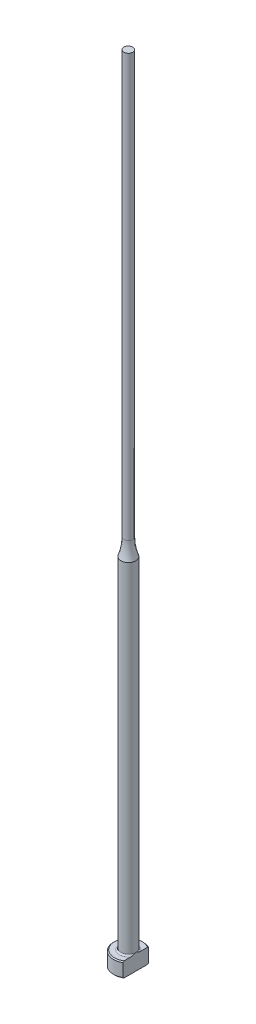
ISO-10303-21;
HEADER;
FILE_DESCRIPTION(('STEP AP214'),'2;1');
FILE_NAME('part.step','',(''),(''),'','','');
FILE_SCHEMA(('AUTOMOTIVE_DESIGN { 1 0 10303 214 1 1 1 1 }'));
ENDSEC;
DATA;
#1=APPLICATION_CONTEXT('core data for automotive mechanical design processes');
#2=APPLICATION_PROTOCOL_DEFINITION('international standard','automotive_design',2000,#1);
#3=PRODUCT_CONTEXT('',#1,'mechanical');
#4=PRODUCT('Part','Part','',(#3));
#5=PRODUCT_RELATED_PRODUCT_CATEGORY('part','',(#4));
#6=PRODUCT_DEFINITION_FORMATION('','',#4);
#7=PRODUCT_DEFINITION_CONTEXT('part definition',#1,'design');
#8=PRODUCT_DEFINITION('design','',#6,#7);
#9=PRODUCT_DEFINITION_SHAPE('','',#8);
#10=(LENGTH_UNIT() NAMED_UNIT(*) SI_UNIT(.MILLI.,.METRE.));
#11=(NAMED_UNIT(*) PLANE_ANGLE_UNIT() SI_UNIT($,.RADIAN.));
#12=(NAMED_UNIT(*) SI_UNIT($,.STERADIAN.) SOLID_ANGLE_UNIT());
#13=UNCERTAINTY_MEASURE_WITH_UNIT(LENGTH_MEASURE(1.E-05),#10,'distance_accuracy_value','');
#14=(GEOMETRIC_REPRESENTATION_CONTEXT(3) GLOBAL_UNCERTAINTY_ASSIGNED_CONTEXT((#13)) GLOBAL_UNIT_ASSIGNED_CONTEXT((#10,
#11,#12)) REPRESENTATION_CONTEXT('',''));
#15=CARTESIAN_POINT('',(0.,0.,0.));
#16=DIRECTION('',(0.,0.,1.));
#17=DIRECTION('',(1.,0.,0.));
#18=AXIS2_PLACEMENT_3D('',#15,#16,#17);
#19=CARTESIAN_POINT('',(-2.99999999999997,3.,0.));
#20=DIRECTION('',(0.,1.,0.));
#21=DIRECTION('',(0.,0.,1.));
#22=AXIS2_PLACEMENT_3D('',#19,#20,#21);
#23=PLANE('',#22);
#24=CARTESIAN_POINT('',(0.,3.,0.));
#25=DIRECTION('',(0.,1.,0.));
#26=DIRECTION('',(0.,0.,1.));
#27=AXIS2_PLACEMENT_3D('',#24,#25,#26);
#28=CIRCLE('',#27,2.79999999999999);
#29=CARTESIAN_POINT('',(1.49999999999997,3.,-2.36431808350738));
#30=VERTEX_POINT('',#29);
#31=CARTESIAN_POINT('',(1.49999999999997,3.,2.36431808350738));
#32=VERTEX_POINT('',#31);
#33=EDGE_CURVE('E187',#30,#32,#28,.T.);
#34=ORIENTED_EDGE('',*,*,#33,.T.);
#35=DIRECTION('',(0.,0.,-1.));
#36=VECTOR('',#35,1.);
#37=CARTESIAN_POINT('',(1.49999999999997,3.,0.));
#38=LINE('',#37,#36);
#39=CARTESIAN_POINT('',(1.49999999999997,3.00000000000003,0.99498743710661));
#40=VERTEX_POINT('',#39);
#41=EDGE_CURVE('E57',#32,#40,#38,.T.);
#42=ORIENTED_EDGE('',*,*,#41,.T.);
#43=CARTESIAN_POINT('',(0.,3.,0.));
#44=DIRECTION('',(0.,1.,0.));
#45=DIRECTION('',(0.,0.,1.));
#46=AXIS2_PLACEMENT_3D('',#43,#44,#45);
#47=CIRCLE('',#46,1.79999999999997);
#48=CARTESIAN_POINT('',(1.49999999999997,3.00000000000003,-0.994987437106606));
#49=VERTEX_POINT('',#48);
#50=EDGE_CURVE('E108',#40,#49,#47,.F.);
#51=ORIENTED_EDGE('',*,*,#50,.T.);
#52=EDGE_CURVE('E137',#49,#30,#38,.T.);
#53=ORIENTED_EDGE('',*,*,#52,.T.);
#54=EDGE_LOOP('',(#34,#42,#51,#53));
#55=FACE_BOUND('',#54,.T.);
#56=ADVANCED_FACE('F32',(#55),#23,.T.);
#57=CARTESIAN_POINT('',(0.,259.958771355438,0.));
#58=DIRECTION('',(0.,1.,0.));
#59=DIRECTION('',(0.,0.,1.));
#60=AXIS2_PLACEMENT_3D('',#57,#58,#59);
#61=CYLINDRICAL_SURFACE('',#60,2.99999999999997);
#62=CARTESIAN_POINT('',(0.,2.80000000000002,0.));
#63=DIRECTION('',(0.,1.,0.));
#64=DIRECTION('',(0.,0.,1.));
#65=AXIS2_PLACEMENT_3D('',#62,#63,#64);
#66=CIRCLE('',#65,2.99999999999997);
#67=CARTESIAN_POINT('',(1.49999999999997,2.80000000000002,2.5980762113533));
#68=VERTEX_POINT('',#67);
#69=CARTESIAN_POINT('',(1.49999999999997,2.80000000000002,-2.5980762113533));
#70=VERTEX_POINT('',#69);
#71=EDGE_CURVE('E105',#68,#70,#66,.F.);
#72=ORIENTED_EDGE('',*,*,#71,.T.);
#73=DIRECTION('',(0.,-1.,0.));
#74=VECTOR('',#73,1.);
#75=CARTESIAN_POINT('',(1.49999999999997,160.,-2.5980762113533));
#76=LINE('',#75,#74);
#77=CARTESIAN_POINT('',(1.49999999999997,0.200000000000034,-2.5980762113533));
#78=VERTEX_POINT('',#77);
#79=EDGE_CURVE('E193',#70,#78,#76,.T.);
#80=ORIENTED_EDGE('',*,*,#79,.T.);
#81=CARTESIAN_POINT('',(0.,0.200000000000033,0.));
#82=DIRECTION('',(0.,-1.,0.));
#83=DIRECTION('',(0.,0.,-1.));
#84=AXIS2_PLACEMENT_3D('',#81,#82,#83);
#85=CIRCLE('',#84,2.99999999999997);
#86=CARTESIAN_POINT('',(1.49999999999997,0.200000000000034,2.5980762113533));
#87=VERTEX_POINT('',#86);
#88=EDGE_CURVE('E100',#78,#87,#85,.F.);
#89=ORIENTED_EDGE('',*,*,#88,.T.);
#90=DIRECTION('',(0.,-1.,0.));
#91=VECTOR('',#90,1.);
#92=CARTESIAN_POINT('',(1.49999999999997,160.,2.5980762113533));
#93=LINE('',#92,#91);
#94=EDGE_CURVE('E93',#68,#87,#93,.T.);
#95=ORIENTED_EDGE('',*,*,#94,.F.);
#96=EDGE_LOOP('',(#72,#80,#89,#95));
#97=FACE_BOUND('',#96,.T.);
#98=ADVANCED_FACE('F158',(#97),#61,.T.);
#99=CARTESIAN_POINT('',(0.,0.,0.));
#100=DIRECTION('',(0.,-1.,0.));
#101=DIRECTION('',(0.,0.,-1.));
#102=AXIS2_PLACEMENT_3D('',#99,#100,#101);
#103=PLANE('',#102);
#104=CARTESIAN_POINT('',(0.,0.,0.));
#105=DIRECTION('',(0.,-1.,0.));
#106=DIRECTION('',(0.,0.,-1.));
#107=AXIS2_PLACEMENT_3D('',#104,#105,#106);
#108=CIRCLE('',#107,2.79999999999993);
#109=CARTESIAN_POINT('',(1.49999999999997,0.,2.36431808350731));
#110=VERTEX_POINT('',#109);
#111=CARTESIAN_POINT('',(1.49999999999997,0.,-2.36431808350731));
#112=VERTEX_POINT('',#111);
#113=EDGE_CURVE('E98',#110,#112,#108,.T.);
#114=ORIENTED_EDGE('',*,*,#113,.T.);
#115=DIRECTION('',(0.,0.,1.));
#116=VECTOR('',#115,1.);
#117=CARTESIAN_POINT('',(1.49999999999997,0.,-2.5980762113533));
#118=LINE('',#117,#116);
#119=EDGE_CURVE('E83',#112,#110,#118,.T.);
#120=ORIENTED_EDGE('',*,*,#119,.T.);
#121=EDGE_LOOP('',(#114,#120));
#122=FACE_BOUND('',#121,.T.);
#123=ADVANCED_FACE('F103',(#122),#103,.T.);
#124=CARTESIAN_POINT('',(0.,3.,0.));
#125=DIRECTION('',(0.,-1.,0.));
#126=DIRECTION('',(0.,0.,-1.));
#127=AXIS2_PLACEMENT_3D('',#124,#125,#126);
#128=CONICAL_SURFACE('',#127,2.79999999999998,0.785398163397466);
#129=ORIENTED_EDGE('',*,*,#71,.F.);
#130=CARTESIAN_POINT('',(1.49999999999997,-0.111741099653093,5.71827621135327));
#131=CARTESIAN_POINT('',(1.49999999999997,0.0136183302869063,5.58866816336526));
#132=CARTESIAN_POINT('',(1.49999999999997,0.138843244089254,5.45892957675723));
#133=CARTESIAN_POINT('',(1.49999999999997,0.388944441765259,5.19911365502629));
#134=CARTESIAN_POINT('',(1.49999999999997,0.513820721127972,5.06903631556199));
#135=CARTESIAN_POINT('',(1.49999999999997,0.763205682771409,4.80840180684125));
#136=CARTESIAN_POINT('',(1.49999999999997,0.887714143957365,4.67784442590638));
#137=CARTESIAN_POINT('',(1.49999999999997,1.13618059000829,4.41620813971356));
#138=CARTESIAN_POINT('',(1.49999999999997,1.26013857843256,4.28512923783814));
#139=CARTESIAN_POINT('',(1.49999999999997,1.50488975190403,4.02490837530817));
#140=CARTESIAN_POINT('',(1.49999999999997,1.6256969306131,3.89577958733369));
#141=CARTESIAN_POINT('',(1.49999999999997,1.86640694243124,3.63668213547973));
#142=CARTESIAN_POINT('',(1.49999999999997,1.98630978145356,3.50671347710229));
#143=CARTESIAN_POINT('',(1.49999999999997,2.22486033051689,3.24567921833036));
#144=CARTESIAN_POINT('',(1.49999999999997,2.34350830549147,3.11461386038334));
#145=CARTESIAN_POINT('',(1.49999999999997,2.57907716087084,2.85094268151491));
#146=CARTESIAN_POINT('',(1.49999999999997,2.69599811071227,2.71833692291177));
#147=CARTESIAN_POINT('',(1.49999999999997,2.88262371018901,2.50255231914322));
#148=CARTESIAN_POINT('',(1.49999999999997,2.95312454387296,2.42006293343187));
#149=CARTESIAN_POINT('',(1.49999999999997,3.0928709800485,2.25401084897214));
#150=CARTESIAN_POINT('',(1.49999999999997,3.16211645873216,2.17044804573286));
#151=CARTESIAN_POINT('',(1.49999999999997,3.29964684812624,2.00105967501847));
#152=CARTESIAN_POINT('',(1.49999999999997,3.36791386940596,1.91521952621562));
#153=CARTESIAN_POINT('',(1.49999999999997,3.50205840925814,1.74171392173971));
#154=CARTESIAN_POINT('',(1.49999999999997,3.56793649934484,1.65404891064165));
#155=CARTESIAN_POINT('',(1.49999999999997,3.69728151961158,1.47490236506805));
#156=CARTESIAN_POINT('',(1.49999999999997,3.76069661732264,1.38338308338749));
#157=CARTESIAN_POINT('',(1.49999999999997,3.8823953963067,1.19675661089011));
#158=CARTESIAN_POINT('',(1.49999999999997,3.94067201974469,1.10164473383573));
#159=CARTESIAN_POINT('',(1.49999999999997,4.04841325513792,0.908008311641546));
#160=CARTESIAN_POINT('',(1.49999999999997,4.0979780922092,0.809540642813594));
#161=CARTESIAN_POINT('',(1.49999999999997,4.18432188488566,0.607192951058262));
#162=CARTESIAN_POINT('',(1.49999999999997,4.22114374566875,0.503332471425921));
#163=CARTESIAN_POINT('',(1.49999999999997,4.26099935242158,0.347577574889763));
#164=CARTESIAN_POINT('',(1.49999999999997,4.27157029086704,0.297609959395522));
#165=CARTESIAN_POINT('',(1.49999999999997,4.28794860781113,0.196885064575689));
#166=CARTESIAN_POINT('',(1.49999999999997,4.29375640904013,0.146127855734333));
#167=CARTESIAN_POINT('',(1.49999999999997,4.30019707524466,0.0444388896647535));
#168=CARTESIAN_POINT('',(1.49999999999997,4.30084594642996,-0.00649183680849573));
#169=CARTESIAN_POINT('',(1.49999999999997,4.29696416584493,-0.108155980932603));
#170=CARTESIAN_POINT('',(1.49999999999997,4.29243308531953,-0.15888938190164));
#171=CARTESIAN_POINT('',(1.49999999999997,4.27856915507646,-0.259234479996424));
#172=CARTESIAN_POINT('',(1.49999999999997,4.26927821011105,-0.30885208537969));
#173=CARTESIAN_POINT('',(1.49999999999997,4.24647108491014,-0.407110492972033));
#174=CARTESIAN_POINT('',(1.49999999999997,4.2329532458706,-0.455750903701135));
#175=CARTESIAN_POINT('',(1.49999999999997,4.20226175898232,-0.552149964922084));
#176=CARTESIAN_POINT('',(1.49999999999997,4.18506801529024,-0.599902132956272));
#177=CARTESIAN_POINT('',(1.49999999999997,4.14771387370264,-0.694205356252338));
#178=CARTESIAN_POINT('',(1.49999999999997,4.1275540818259,-0.740756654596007));
#179=CARTESIAN_POINT('',(1.49999999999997,4.06327696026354,-0.879166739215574));
#180=CARTESIAN_POINT('',(1.49999999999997,4.01551721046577,-0.969329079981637));
#181=CARTESIAN_POINT('',(1.49999999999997,3.91367909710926,-1.1460431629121));
#182=CARTESIAN_POINT('',(1.49999999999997,3.85959300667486,-1.23259031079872));
#183=CARTESIAN_POINT('',(1.49999999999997,3.74697968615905,-1.40321348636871));
#184=CARTESIAN_POINT('',(1.49999999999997,3.68843573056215,-1.48727838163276));
#185=CARTESIAN_POINT('',(1.49999999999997,3.56843845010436,-1.65322187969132));
#186=CARTESIAN_POINT('',(1.49999999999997,3.50698656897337,-1.73510153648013));
#187=CARTESIAN_POINT('',(1.49999999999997,3.38115673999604,-1.89829823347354));
#188=CARTESIAN_POINT('',(1.49999999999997,3.31675092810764,-1.97959369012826));
#189=CARTESIAN_POINT('',(1.49999999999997,3.18634068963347,-2.14090082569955));
#190=CARTESIAN_POINT('',(1.49999999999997,3.12033609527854,-2.22091236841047));
#191=CARTESIAN_POINT('',(1.49999999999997,2.92086431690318,-2.45906508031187));
#192=CARTESIAN_POINT('',(1.49999999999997,2.78562663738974,-2.61572090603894));
#193=CARTESIAN_POINT('',(1.49999999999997,2.53554498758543,-2.90006295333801));
#194=CARTESIAN_POINT('',(1.49999999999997,2.42114543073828,-3.02814382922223));
#195=CARTESIAN_POINT('',(1.49999999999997,2.19093557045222,-3.28303767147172));
#196=CARTESIAN_POINT('',(1.49999999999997,2.07512522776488,-3.40985060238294));
#197=CARTESIAN_POINT('',(1.49999999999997,1.72597067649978,-3.7891384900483));
#198=CARTESIAN_POINT('',(1.49999999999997,1.49111760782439,-4.04022177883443));
#199=CARTESIAN_POINT('',(1.49999999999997,1.02882478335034,-4.52992803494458));
#200=CARTESIAN_POINT('',(1.49999999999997,0.801477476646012,-4.76863870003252));
#201=CARTESIAN_POINT('',(1.49999999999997,0.459548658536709,-5.12558036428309));
#202=CARTESIAN_POINT('',(1.49999999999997,0.345484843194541,-5.2443077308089));
#203=CARTESIAN_POINT('',(1.49999999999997,0.117071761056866,-5.48148573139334));
#204=CARTESIAN_POINT('',(1.49999999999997,0.00272249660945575,-5.59993636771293));
#205=CARTESIAN_POINT('',(1.49999999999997,-0.111741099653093,-5.71827621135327));
#206=B_SPLINE_CURVE_WITH_KNOTS('',3,(#130,#131,#132,#133,#134,#135,#136,#137,#138,#139,#140,
#141,#142,#143,#144,#145,#146,#147,#148,#149,#150,#151,#152,#153,#154,#155,#156,#157,#158,#159,
#160,#161,#162,#163,#164,#165,#166,#167,#168,#169,#170,#171,#172,#173,#174,#175,#176,#177,#178,
#179,#180,#181,#182,#183,#184,#185,#186,#187,#188,#189,#190,#191,#192,#193,#194,#195,#196,#197,
#198,#199,#200,#201,#202,#203,#204,#205),.UNSPECIFIED.,.F.,.F.,(4,2,2,2,2,2,2,2,2,2,2,2,2,2,2,2,
2,2,2,2,2,2,2,2,2,2,2,2,2,2,2,2,2,2,2,2,2,4),(0.,0.540943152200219,1.08189327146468,
1.62312052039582,2.16434426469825,2.69482920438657,3.22531067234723,3.75567781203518,
4.2860235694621,4.61155053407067,4.93710943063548,5.2661094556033,5.59503024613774,
5.92894782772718,6.26331713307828,6.59354403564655,6.92264800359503,7.0756747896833,
7.22868799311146,7.38122626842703,7.53377717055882,7.68500755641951,7.83629736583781,
7.98843643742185,8.14054446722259,8.44618799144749,8.75220879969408,9.05944044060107,
9.36652111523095,9.67764287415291,9.98879742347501,10.6095925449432,11.1247803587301,
11.6399825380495,12.6713544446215,13.6603005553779,14.1542238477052,14.6481430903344),.UNSPECIFIED.);
#207=EDGE_CURVE('E136',#68,#32,#206,.T.);
#208=ORIENTED_EDGE('',*,*,#207,.T.);
#209=ORIENTED_EDGE('',*,*,#33,.F.);
#210=EDGE_CURVE('E128',#30,#70,#206,.T.);
#211=ORIENTED_EDGE('',*,*,#210,.T.);
#212=EDGE_LOOP('',(#129,#208,#209,#211));
#213=FACE_BOUND('',#212,.T.);
#214=ADVANCED_FACE('F144',(#213),#128,.T.);
#215=CARTESIAN_POINT('',(0.,0.200000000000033,0.));
#216=DIRECTION('',(0.,1.,0.));
#217=DIRECTION('',(0.,0.,1.));
#218=AXIS2_PLACEMENT_3D('',#215,#216,#217);
#219=CONICAL_SURFACE('',#218,2.99999999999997,0.785398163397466);
#220=ORIENTED_EDGE('',*,*,#88,.F.);
#221=CARTESIAN_POINT('',(1.49999999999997,3.11174109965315,-5.71827621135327));
#222=CARTESIAN_POINT('',(1.49999999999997,2.98638166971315,-5.58866816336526));
#223=CARTESIAN_POINT('',(1.49999999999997,2.8611567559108,-5.45892957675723));
#224=CARTESIAN_POINT('',(1.49999999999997,2.6110555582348,-5.19911365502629));
#225=CARTESIAN_POINT('',(1.49999999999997,2.48617927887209,-5.06903631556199));
#226=CARTESIAN_POINT('',(1.49999999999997,2.23679431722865,-4.80840180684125));
#227=CARTESIAN_POINT('',(1.49999999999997,2.11228585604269,-4.67784442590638));
#228=CARTESIAN_POINT('',(1.49999999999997,1.86381940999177,-4.41620813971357));
#229=CARTESIAN_POINT('',(1.49999999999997,1.7398614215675,-4.28512923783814));
#230=CARTESIAN_POINT('',(1.49999999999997,1.49511024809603,-4.02490837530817));
#231=CARTESIAN_POINT('',(1.49999999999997,1.37430306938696,-3.89577958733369));
#232=CARTESIAN_POINT('',(1.49999999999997,1.13359305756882,-3.63668213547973));
#233=CARTESIAN_POINT('',(1.49999999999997,1.0136902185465,-3.50671347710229));
#234=CARTESIAN_POINT('',(1.49999999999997,0.775139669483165,-3.24567921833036));
#235=CARTESIAN_POINT('',(1.49999999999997,0.656491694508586,-3.11461386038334));
#236=CARTESIAN_POINT('',(1.49999999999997,0.420922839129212,-2.85094268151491));
#237=CARTESIAN_POINT('',(1.49999999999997,0.304001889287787,-2.71833692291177));
#238=CARTESIAN_POINT('',(1.49999999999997,0.117376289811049,-2.50255231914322));
#239=CARTESIAN_POINT('',(1.49999999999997,0.0468754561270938,-2.42006293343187));
#240=CARTESIAN_POINT('',(1.49999999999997,-0.0928709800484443,-2.25401084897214));
#241=CARTESIAN_POINT('',(1.49999999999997,-0.162116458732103,-2.17044804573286));
#242=CARTESIAN_POINT('',(1.49999999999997,-0.299646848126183,-2.00105967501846));
#243=CARTESIAN_POINT('',(1.49999999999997,-0.367913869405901,-1.91521952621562));
#244=CARTESIAN_POINT('',(1.49999999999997,-0.502058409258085,-1.74171392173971));
#245=CARTESIAN_POINT('',(1.49999999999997,-0.567936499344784,-1.65404891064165));
#246=CARTESIAN_POINT('',(1.49999999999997,-0.697281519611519,-1.47490236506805));
#247=CARTESIAN_POINT('',(1.49999999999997,-0.760696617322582,-1.38338308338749));
#248=CARTESIAN_POINT('',(1.49999999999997,-0.882395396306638,-1.19675661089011));
#249=CARTESIAN_POINT('',(1.49999999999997,-0.940672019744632,-1.10164473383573));
#250=CARTESIAN_POINT('',(1.49999999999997,-1.04841325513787,-0.908008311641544));
#251=CARTESIAN_POINT('',(1.49999999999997,-1.09797809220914,-0.809540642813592));
#252=CARTESIAN_POINT('',(1.49999999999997,-1.1843218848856,-0.60719295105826));
#253=CARTESIAN_POINT('',(1.49999999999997,-1.22114374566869,-0.503332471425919));
#254=CARTESIAN_POINT('',(1.49999999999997,-1.26099935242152,-0.347577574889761));
#255=CARTESIAN_POINT('',(1.49999999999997,-1.27157029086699,-0.29760995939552));
#256=CARTESIAN_POINT('',(1.49999999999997,-1.28794860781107,-0.196885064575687));
#257=CARTESIAN_POINT('',(1.49999999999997,-1.29375640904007,-0.146127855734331));
#258=CARTESIAN_POINT('',(1.49999999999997,-1.30019707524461,-0.0444388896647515));
#259=CARTESIAN_POINT('',(1.49999999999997,-1.3008459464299,0.00649183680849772));
#260=CARTESIAN_POINT('',(1.49999999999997,-1.29696416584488,0.108155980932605));
#261=CARTESIAN_POINT('',(1.49999999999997,-1.29243308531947,0.158889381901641));
#262=CARTESIAN_POINT('',(1.49999999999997,-1.2785691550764,0.259234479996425));
#263=CARTESIAN_POINT('',(1.49999999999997,-1.26927821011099,0.308852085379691));
#264=CARTESIAN_POINT('',(1.49999999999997,-1.24647108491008,0.407110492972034));
#265=CARTESIAN_POINT('',(1.49999999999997,-1.23295324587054,0.455750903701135));
#266=CARTESIAN_POINT('',(1.49999999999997,-1.20226175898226,0.552149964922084));
#267=CARTESIAN_POINT('',(1.49999999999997,-1.18506801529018,0.599902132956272));
#268=CARTESIAN_POINT('',(1.49999999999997,-1.14771387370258,0.694205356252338));
#269=CARTESIAN_POINT('',(1.49999999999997,-1.12755408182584,0.740756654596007));
#270=CARTESIAN_POINT('',(1.49999999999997,-1.06327696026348,0.879166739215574));
#271=CARTESIAN_POINT('',(1.49999999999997,-1.01551721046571,0.969329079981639));
#272=CARTESIAN_POINT('',(1.49999999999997,-0.913679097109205,1.1460431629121));
#273=CARTESIAN_POINT('',(1.49999999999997,-0.8595930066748,1.23259031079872));
#274=CARTESIAN_POINT('',(1.49999999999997,-0.746979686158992,1.40321348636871));
#275=CARTESIAN_POINT('',(1.49999999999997,-0.688435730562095,1.48727838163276));
#276=CARTESIAN_POINT('',(1.49999999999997,-0.568438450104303,1.65322187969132));
#277=CARTESIAN_POINT('',(1.49999999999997,-0.506986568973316,1.73510153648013));
#278=CARTESIAN_POINT('',(1.49999999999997,-0.381156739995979,1.89829823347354));
#279=CARTESIAN_POINT('',(1.49999999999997,-0.316750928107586,1.97959369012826));
#280=CARTESIAN_POINT('',(1.49999999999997,-0.186340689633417,2.14090082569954));
#281=CARTESIAN_POINT('',(1.49999999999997,-0.120336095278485,2.22091236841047));
#282=CARTESIAN_POINT('',(1.49999999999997,0.0791356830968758,2.45906508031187));
#283=CARTESIAN_POINT('',(1.49999999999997,0.214373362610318,2.61572090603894));
#284=CARTESIAN_POINT('',(1.49999999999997,0.46445501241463,2.90006295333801));
#285=CARTESIAN_POINT('',(1.49999999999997,0.578854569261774,3.02814382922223));
#286=CARTESIAN_POINT('',(1.49999999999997,0.809064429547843,3.28303767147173));
#287=CARTESIAN_POINT('',(1.49999999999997,0.924874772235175,3.40985060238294));
#288=CARTESIAN_POINT('',(1.49999999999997,1.27402932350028,3.78913849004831));
#289=CARTESIAN_POINT('',(1.49999999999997,1.50888239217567,4.04022177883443));
#290=CARTESIAN_POINT('',(1.49999999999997,1.97117521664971,4.52992803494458));
#291=CARTESIAN_POINT('',(1.49999999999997,2.19852252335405,4.76863870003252));
#292=CARTESIAN_POINT('',(1.49999999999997,2.54045134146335,5.12558036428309));
#293=CARTESIAN_POINT('',(1.49999999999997,2.65451515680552,5.2443077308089));
#294=CARTESIAN_POINT('',(1.49999999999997,2.88292823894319,5.48148573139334));
#295=CARTESIAN_POINT('',(1.49999999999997,2.9972775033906,5.59993636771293));
#296=CARTESIAN_POINT('',(1.49999999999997,3.11174109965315,5.71827621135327));
#297=B_SPLINE_CURVE_WITH_KNOTS('',3,(#221,#222,#223,#224,#225,#226,#227,#228,#229,#230,#231,
#232,#233,#234,#235,#236,#237,#238,#239,#240,#241,#242,#243,#244,#245,#246,#247,#248,#249,#250,
#251,#252,#253,#254,#255,#256,#257,#258,#259,#260,#261,#262,#263,#264,#265,#266,#267,#268,#269,
#270,#271,#272,#273,#274,#275,#276,#277,#278,#279,#280,#281,#282,#283,#284,#285,#286,#287,#288,
#289,#290,#291,#292,#293,#294,#295,#296),.UNSPECIFIED.,.F.,.F.,(4,2,2,2,2,2,2,2,2,2,2,2,2,2,2,2,
2,2,2,2,2,2,2,2,2,2,2,2,2,2,2,2,2,2,2,2,2,4),(0.,0.540943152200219,1.08189327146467,
1.62312052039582,2.16434426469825,2.69482920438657,3.22531067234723,3.75567781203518,
4.28602356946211,4.61155053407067,4.93710943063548,5.2661094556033,5.59503024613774,
5.92894782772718,6.26331713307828,6.59354403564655,6.92264800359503,7.0756747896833,
7.22868799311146,7.38122626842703,7.53377717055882,7.68500755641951,7.83629736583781,
7.98843643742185,8.14054446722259,8.4461879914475,8.75220879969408,9.05944044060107,
9.36652111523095,9.6776428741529,9.98879742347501,10.6095925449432,11.1247803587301,
11.6399825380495,12.6713544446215,13.6603005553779,14.1542238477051,14.6481430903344),.UNSPECIFIED.);
#298=EDGE_CURVE('E86',#78,#112,#297,.T.);
#299=ORIENTED_EDGE('',*,*,#298,.T.);
#300=ORIENTED_EDGE('',*,*,#113,.F.);
#301=EDGE_CURVE('E89',#110,#87,#297,.T.);
#302=ORIENTED_EDGE('',*,*,#301,.T.);
#303=EDGE_LOOP('',(#220,#299,#300,#302));
#304=FACE_BOUND('',#303,.T.);
#305=ADVANCED_FACE('F97',(#304),#219,.T.);
#306=CARTESIAN_POINT('',(0.,3.30000000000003,0.));
#307=DIRECTION('',(0.,1.,0.));
#308=DIRECTION('',(0.,0.,1.));
#309=AXIS2_PLACEMENT_3D('',#306,#307,#308);
#310=TOROIDAL_SURFACE('',#309,1.79999999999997,0.3);
#311=CARTESIAN_POINT('',(1.49999999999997,3.30000000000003,0.));
#312=CARTESIAN_POINT('',(1.49999999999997,3.300000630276,3.41555678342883E-12));
#313=CARTESIAN_POINT('',(1.49999999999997,3.30000126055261,-1.15373640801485E-07));
#314=CARTESIAN_POINT('',(1.49999999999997,3.3000024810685,-4.90631575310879E-07));
#315=CARTESIAN_POINT('',(1.49999999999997,3.30000307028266,-7.53296670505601E-07));
#316=CARTESIAN_POINT('',(1.49999999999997,3.30000424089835,-1.38757096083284E-06));
#317=CARTESIAN_POINT('',(1.49999999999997,3.300004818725,-1.76563001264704E-06));
#318=CARTESIAN_POINT('',(1.49999999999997,3.30000591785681,-2.58768006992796E-06));
#319=CARTESIAN_POINT('',(1.49999999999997,3.30000643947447,-3.03127014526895E-06));
#320=CARTESIAN_POINT('',(1.49999999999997,3.30000815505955,-4.60021967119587E-06));
#321=CARTESIAN_POINT('',(1.49999999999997,3.30000927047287,-5.8124152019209E-06));
#322=CARTESIAN_POINT('',(1.49999999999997,3.30001128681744,-8.33989413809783E-06));
#323=CARTESIAN_POINT('',(1.49999999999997,3.30001219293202,-9.65128157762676E-06));
#324=CARTESIAN_POINT('',(1.49999999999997,3.30001551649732,-1.46782505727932E-05));
#325=CARTESIAN_POINT('',(1.49999999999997,3.30001775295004,-1.8517976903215E-05));
#326=CARTESIAN_POINT('',(1.49999999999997,3.30002148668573,-2.61616194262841E-05));
#327=CARTESIAN_POINT('',(1.49999999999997,3.30002302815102,-2.99447742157E-05));
#328=CARTESIAN_POINT('',(1.49999999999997,3.30002943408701,-4.58003743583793E-05));
#329=CARTESIAN_POINT('',(1.49999999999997,3.3000341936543,-5.79079078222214E-05));
#330=CARTESIAN_POINT('',(1.49999999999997,3.30004197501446,-8.07263755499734E-05));
#331=CARTESIAN_POINT('',(1.49999999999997,3.30004514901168,-9.13834709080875E-05));
#332=CARTESIAN_POINT('',(1.49999999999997,3.30006989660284,-0.000167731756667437));
#333=CARTESIAN_POINT('',(1.49999999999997,3.30010092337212,-0.000229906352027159));
#334=CARTESIAN_POINT('',(1.49999999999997,3.30021632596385,-0.000470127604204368));
#335=CARTESIAN_POINT('',(1.49999999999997,3.30029368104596,-0.000650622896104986));
#336=CARTESIAN_POINT('',(1.49999999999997,3.30059619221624,-0.00134589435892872));
#337=CARTESIAN_POINT('',(1.49999999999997,3.30082870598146,-0.00185814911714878));
#338=CARTESIAN_POINT('',(1.49999999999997,3.30176696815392,-0.00393547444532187));
#339=CARTESIAN_POINT('',(1.49999999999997,3.30246445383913,-0.00550332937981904));
#340=CARTESIAN_POINT('',(1.49999999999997,3.31426785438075,-0.0320229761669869));
#341=CARTESIAN_POINT('',(1.49999999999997,3.32544800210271,-0.0569503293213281));
#342=CARTESIAN_POINT('',(1.49999999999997,3.34725700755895,-0.105984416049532));
#343=CARTESIAN_POINT('',(1.49999999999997,3.35789134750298,-0.130088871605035));
#344=CARTESIAN_POINT('',(1.49999999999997,3.38015321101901,-0.181096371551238));
#345=CARTESIAN_POINT('',(1.49999999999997,3.39175804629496,-0.208009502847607));
#346=CARTESIAN_POINT('',(1.49999999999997,3.41469034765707,-0.262264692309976));
#347=CARTESIAN_POINT('',(1.49999999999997,3.42601398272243,-0.289608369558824));
#348=CARTESIAN_POINT('',(1.49999999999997,3.45363212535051,-0.35820378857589));
#349=CARTESIAN_POINT('',(1.49999999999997,3.46959026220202,-0.39959288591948));
#350=CARTESIAN_POINT('',(1.49999999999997,3.49940505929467,-0.482097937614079));
#351=CARTESIAN_POINT('',(1.49999999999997,3.51330033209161,-0.523199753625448));
#352=CARTESIAN_POINT('',(1.49999999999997,3.53552507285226,-0.595497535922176));
#353=CARTESIAN_POINT('',(1.49999999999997,3.54436834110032,-0.626532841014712));
#354=CARTESIAN_POINT('',(1.49999999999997,3.56052427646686,-0.6891760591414));
#355=CARTESIAN_POINT('',(1.49999999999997,3.5678279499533,-0.720786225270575));
#356=CARTESIAN_POINT('',(1.49999999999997,3.5875075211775,-0.819524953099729));
#357=CARTESIAN_POINT('',(1.49999999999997,3.59661044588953,-0.88742909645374));
#358=CARTESIAN_POINT('',(1.49999999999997,3.60059842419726,-0.991180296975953));
#359=CARTESIAN_POINT('',(1.49999999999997,3.60019840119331,-1.02684364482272));
#360=CARTESIAN_POINT('',(1.49999999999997,3.59497085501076,-1.097505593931));
#361=CARTESIAN_POINT('',(1.49999999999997,3.59019295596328,-1.13250716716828));
#362=CARTESIAN_POINT('',(1.49999999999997,3.57687734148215,-1.19353096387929));
#363=CARTESIAN_POINT('',(1.49999999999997,3.56943875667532,-1.21978854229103));
#364=CARTESIAN_POINT('',(1.49999999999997,3.55063748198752,-1.27094658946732));
#365=CARTESIAN_POINT('',(1.49999999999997,3.53927342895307,-1.29584658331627));
#366=CARTESIAN_POINT('',(1.49999999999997,3.51660016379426,-1.33501873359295));
#367=CARTESIAN_POINT('',(1.49999999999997,3.50657738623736,-1.35003296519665));
#368=CARTESIAN_POINT('',(1.49999999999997,3.48437469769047,-1.37837252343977));
#369=CARTESIAN_POINT('',(1.49999999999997,3.47219867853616,-1.39170082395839));
#370=CARTESIAN_POINT('',(1.49999999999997,3.44835614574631,-1.41349417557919));
#371=CARTESIAN_POINT('',(1.49999999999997,3.43709185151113,-1.42239673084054));
#372=CARTESIAN_POINT('',(1.49999999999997,3.41325256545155,-1.43825467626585));
#373=CARTESIAN_POINT('',(1.49999999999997,3.40067804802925,-1.44521076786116));
#374=CARTESIAN_POINT('',(1.49999999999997,3.37433767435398,-1.45677158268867));
#375=CARTESIAN_POINT('',(1.49999999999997,3.36056203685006,-1.46135438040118));
#376=CARTESIAN_POINT('',(1.49999999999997,3.33237324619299,-1.46767730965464));
#377=CARTESIAN_POINT('',(1.49999999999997,3.31796076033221,-1.46942034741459));
#378=CARTESIAN_POINT('',(1.49999999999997,3.29122479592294,-1.4698720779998));
#379=CARTESIAN_POINT('',(1.49999999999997,3.27890664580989,-1.468990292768));
#380=CARTESIAN_POINT('',(1.49999999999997,3.25461019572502,-1.4651157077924));
#381=CARTESIAN_POINT('',(1.49999999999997,3.2426318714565,-1.46212305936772));
#382=CARTESIAN_POINT('',(1.49999999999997,3.21959683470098,-1.4543117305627));
#383=CARTESIAN_POINT('',(1.49999999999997,3.20852542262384,-1.44953579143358));
#384=CARTESIAN_POINT('',(1.49999999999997,3.18721125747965,-1.43840957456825));
#385=CARTESIAN_POINT('',(1.49999999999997,3.1769687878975,-1.43205876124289));
#386=CARTESIAN_POINT('',(1.49999999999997,3.15325976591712,-1.41506353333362));
#387=CARTESIAN_POINT('',(1.49999999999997,3.14027750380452,-1.40374235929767));
#388=CARTESIAN_POINT('',(1.49999999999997,3.11630720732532,-1.37914825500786));
#389=CARTESIAN_POINT('',(1.49999999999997,3.10532420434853,-1.36587054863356));
#390=CARTESIAN_POINT('',(1.49999999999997,3.08100891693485,-1.33197272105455));
#391=CARTESIAN_POINT('',(1.49999999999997,3.06867625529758,-1.31063843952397));
#392=CARTESIAN_POINT('',(1.49999999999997,3.04751867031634,-1.26637455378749));
#393=CARTESIAN_POINT('',(1.49999999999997,3.03869240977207,-1.24344556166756));
#394=CARTESIAN_POINT('',(1.49999999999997,3.01978360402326,-1.18316534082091));
#395=CARTESIAN_POINT('',(1.49999999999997,3.01191472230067,-1.14512623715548));
#396=CARTESIAN_POINT('',(1.49999999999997,3.00188285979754,-1.06789971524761));
#397=CARTESIAN_POINT('',(1.49999999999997,2.99979735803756,-1.02870374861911));
#398=CARTESIAN_POINT('',(1.49999999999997,3.00021727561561,-0.953160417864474));
#399=CARTESIAN_POINT('',(1.49999999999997,3.00240673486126,-0.916808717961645));
#400=CARTESIAN_POINT('',(1.49999999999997,3.0099643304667,-0.844432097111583));
#401=CARTESIAN_POINT('',(1.49999999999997,3.01533462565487,-0.808407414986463));
#402=CARTESIAN_POINT('',(1.49999999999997,3.02828086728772,-0.738670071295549));
#403=CARTESIAN_POINT('',(1.49999999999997,3.03573028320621,-0.704933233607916));
#404=CARTESIAN_POINT('',(1.49999999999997,3.05243174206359,-0.638128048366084));
#405=CARTESIAN_POINT('',(1.49999999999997,3.06167285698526,-0.605056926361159));
#406=CARTESIAN_POINT('',(1.49999999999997,3.08440652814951,-0.53019513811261));
#407=CARTESIAN_POINT('',(1.49999999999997,3.09836576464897,-0.488547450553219));
#408=CARTESIAN_POINT('',(1.49999999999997,3.1283820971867,-0.404954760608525));
#409=CARTESIAN_POINT('',(1.49999999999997,3.14447968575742,-0.363024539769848));
#410=CARTESIAN_POINT('',(1.49999999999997,3.17238454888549,-0.293508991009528));
#411=CARTESIAN_POINT('',(1.49999999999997,3.18384249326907,-0.265781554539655));
#412=CARTESIAN_POINT('',(1.49999999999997,3.20705854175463,-0.210769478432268));
#413=CARTESIAN_POINT('',(1.49999999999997,3.21881265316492,-0.183483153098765));
#414=CARTESIAN_POINT('',(1.49999999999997,3.24136702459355,-0.131772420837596));
#415=CARTESIAN_POINT('',(1.49999999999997,3.25214361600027,-0.107337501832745));
#416=CARTESIAN_POINT('',(1.49999999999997,3.27424746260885,-0.0576321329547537));
#417=CARTESIAN_POINT('',(1.49999999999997,3.28558038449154,-0.0323640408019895));
#418=CARTESIAN_POINT('',(1.49999999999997,3.29753556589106,-0.00550327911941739));
#419=CARTESIAN_POINT('',(1.49999999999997,3.29823307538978,-0.00393537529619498));
#420=CARTESIAN_POINT('',(1.49999999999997,3.29917134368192,-0.00185803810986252));
#421=CARTESIAN_POINT('',(1.49999999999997,3.29940384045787,-0.00134582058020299));
#422=CARTESIAN_POINT('',(1.49999999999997,3.29970633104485,-0.000650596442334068));
#423=CARTESIAN_POINT('',(1.49999999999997,3.29978368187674,-0.000470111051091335));
#424=CARTESIAN_POINT('',(1.49999999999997,3.29989907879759,-0.000229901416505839));
#425=CARTESIAN_POINT('',(1.49999999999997,3.29993010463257,-0.000167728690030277));
#426=CARTESIAN_POINT('',(1.49999999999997,3.29995485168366,-9.13825689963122E-05));
#427=CARTESIAN_POINT('',(1.49999999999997,3.29995802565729,-8.07256241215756E-05));
#428=CARTESIAN_POINT('',(1.49999999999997,3.29996580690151,-5.79074820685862E-05));
#429=CARTESIAN_POINT('',(1.49999999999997,3.29997056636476,-4.5800119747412E-05));
#430=CARTESIAN_POINT('',(1.49999999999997,3.29997697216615,-2.99447119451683E-05));
#431=CARTESIAN_POINT('',(1.49999999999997,3.2999785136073,-2.61615817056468E-05));
#432=CARTESIAN_POINT('',(1.49999999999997,3.2999822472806,-1.85179845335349E-05));
#433=CARTESIAN_POINT('',(1.49999999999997,3.29998448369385,-1.46782782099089E-05));
#434=CARTESIAN_POINT('',(1.49999999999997,3.2999878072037,-9.65132752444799E-06));
#435=CARTESIAN_POINT('',(1.49999999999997,3.299988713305,-8.33994202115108E-06));
#436=CARTESIAN_POINT('',(1.49999999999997,3.29999072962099,-5.81246426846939E-06));
#437=CARTESIAN_POINT('',(1.49999999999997,3.29999184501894,-4.600267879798E-06));
#438=CARTESIAN_POINT('',(1.49999999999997,3.29999356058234,-3.03131394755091E-06));
#439=CARTESIAN_POINT('',(1.49999999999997,3.29999408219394,-2.58772196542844E-06));
#440=CARTESIAN_POINT('',(1.49999999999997,3.2999951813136,-1.76566701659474E-06));
#441=CARTESIAN_POINT('',(1.49999999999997,3.29999575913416,-1.38760497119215E-06));
#442=CARTESIAN_POINT('',(1.49999999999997,3.29999692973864,-7.53323425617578E-07));
#443=CARTESIAN_POINT('',(1.49999999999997,3.29999751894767,-4.90654189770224E-07));
#444=CARTESIAN_POINT('',(1.49999999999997,3.29999873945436,-1.15386267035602E-07));
#445=CARTESIAN_POINT('',(1.49999999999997,3.29999936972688,-3.41554144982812E-12));
#446=CARTESIAN_POINT('',(1.49999999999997,3.30000000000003,0.));
#447=B_SPLINE_CURVE_WITH_KNOTS('',3,(#311,#312,#313,#314,#315,#316,#317,#318,#319,#320,#321,
#322,#323,#324,#325,#326,#327,#328,#329,#330,#331,#332,#333,#334,#335,#336,#337,#338,#339,#340,
#341,#342,#343,#344,#345,#346,#347,#348,#349,#350,#351,#352,#353,#354,#355,#356,#357,#358,#359,
#360,#361,#362,#363,#364,#365,#366,#367,#368,#369,#370,#371,#372,#373,#374,#375,#376,#377,#378,
#379,#380,#381,#382,#383,#384,#385,#386,#387,#388,#389,#390,#391,#392,#393,#394,#395,#396,#397,
#398,#399,#400,#401,#402,#403,#404,#405,#406,#407,#408,#409,#410,#411,#412,#413,#414,#415,#416,
#417,#418,#419,#420,#421,#422,#423,#424,#425,#426,#427,#428,#429,#430,#431,#432,#433,#434,#435,
#436,#437,#438,#439,#440,#441,#442,#443,#444,#445,#446),.UNSPECIFIED.,.T.,.F.,(4,2,2,2,2,2,2,2,
2,2,2,2,2,2,2,2,2,2,2,2,2,2,2,2,2,2,2,2,2,2,2,2,2,2,2,2,2,2,2,2,2,2,2,2,2,2,2,2,2,2,2,2,2,2,2,2,
2,2,2,2,2,2,2,2,2,2,2,4),(0.,1.88906036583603E-06,3.8150959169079E-06,5.87892837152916E-06,
7.93062024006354E-06,1.28480890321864E-05,1.76261717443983E-05,3.0909918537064E-05,
4.31529750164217E-05,8.21699329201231E-05,0.000115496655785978,0.000323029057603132,
0.000912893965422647,0.00259963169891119,0.00774858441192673,0.0896975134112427,
0.168737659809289,0.256660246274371,0.345444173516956,0.478492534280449,0.608603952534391,
0.705372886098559,0.802692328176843,1.00719557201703,1.11399616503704,1.21960092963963,
1.30124317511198,1.38291380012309,1.43690814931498,1.49080588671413,1.53371524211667,
1.57660911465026,1.61989249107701,1.66313154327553,1.69999492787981,1.73685567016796,
1.77288440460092,1.80892540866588,1.86031324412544,1.91182866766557,1.98534297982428,
2.05882922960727,2.1747172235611,2.29215041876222,2.40123170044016,2.51038710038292,
2.613972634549,2.71694519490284,2.84866234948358,2.98337525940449,3.07337666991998,
3.16250453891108,3.24262397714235,3.32569301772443,3.3308421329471,3.33252874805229,
3.33311858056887,3.33332610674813,3.33335943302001,3.33339844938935,3.3334106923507,
3.33342397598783,3.33342875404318,3.33343367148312,3.33343572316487,3.33343778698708,
3.33343971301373,3.33344160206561),.UNSPECIFIED.);
#448=CARTESIAN_POINT('',(1.49999999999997,3.30000000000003,0.));
#449=VERTEX_POINT('',#448);
#450=EDGE_CURVE('E11',#49,#449,#447,.T.);
#451=ORIENTED_EDGE('',*,*,#450,.F.);
#452=ORIENTED_EDGE('',*,*,#50,.F.);
#453=CARTESIAN_POINT('',(1.49999999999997,3.30000000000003,0.));
#454=CARTESIAN_POINT('',(1.49999999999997,3.29999936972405,-3.41547770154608E-12));
#455=CARTESIAN_POINT('',(1.49999999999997,3.29999873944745,1.15373640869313E-07));
#456=CARTESIAN_POINT('',(1.49999999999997,3.29999751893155,4.90631575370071E-07));
#457=CARTESIAN_POINT('',(1.49999999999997,3.29999692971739,7.53296670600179E-07));
#458=CARTESIAN_POINT('',(1.49999999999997,3.2999957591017,1.38757096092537E-06));
#459=CARTESIAN_POINT('',(1.49999999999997,3.29999518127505,1.76563001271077E-06));
#460=CARTESIAN_POINT('',(1.49999999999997,3.29999408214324,2.58768007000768E-06));
#461=CARTESIAN_POINT('',(1.49999999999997,3.29999356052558,3.03127014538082E-06));
#462=CARTESIAN_POINT('',(1.49999999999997,3.2999918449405,4.60021967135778E-06));
#463=CARTESIAN_POINT('',(1.49999999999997,3.29999072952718,5.81241520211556E-06));
#464=CARTESIAN_POINT('',(1.49999999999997,3.29998871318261,8.33989413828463E-06));
#465=CARTESIAN_POINT('',(1.49999999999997,3.29998780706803,9.65128157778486E-06));
#466=CARTESIAN_POINT('',(1.49999999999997,3.29998448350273,1.46782505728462E-05));
#467=CARTESIAN_POINT('',(1.49999999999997,3.29998224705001,1.85179769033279E-05));
#468=CARTESIAN_POINT('',(1.49999999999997,3.29997851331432,2.61616194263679E-05));
#469=CARTESIAN_POINT('',(1.49999999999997,3.29997697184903,2.99447742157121E-05));
#470=CARTESIAN_POINT('',(1.49999999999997,3.29997056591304,4.58003743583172E-05));
#471=CARTESIAN_POINT('',(1.49999999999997,3.29996580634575,5.79079078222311E-05));
#472=CARTESIAN_POINT('',(1.49999999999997,3.29995802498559,8.07263755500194E-05));
#473=CARTESIAN_POINT('',(1.49999999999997,3.29995485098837,9.1383470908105E-05));
#474=CARTESIAN_POINT('',(1.49999999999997,3.29993010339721,0.000167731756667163));
#475=CARTESIAN_POINT('',(1.49999999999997,3.29989907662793,0.000229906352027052));
#476=CARTESIAN_POINT('',(1.49999999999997,3.2997836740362,0.000470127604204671));
#477=CARTESIAN_POINT('',(1.49999999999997,3.2997063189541,0.000650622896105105));
#478=CARTESIAN_POINT('',(1.49999999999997,3.29940380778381,0.00134589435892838));
#479=CARTESIAN_POINT('',(1.49999999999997,3.29917129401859,0.00185814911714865));
#480=CARTESIAN_POINT('',(1.49999999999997,3.29823303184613,0.00393547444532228));
#481=CARTESIAN_POINT('',(1.49999999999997,3.29753554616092,0.00550332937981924));
#482=CARTESIAN_POINT('',(1.49999999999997,3.2857321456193,0.0320229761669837));
#483=CARTESIAN_POINT('',(1.49999999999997,3.27455199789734,0.0569503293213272));
#484=CARTESIAN_POINT('',(1.49999999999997,3.2527429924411,0.105984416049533));
#485=CARTESIAN_POINT('',(1.49999999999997,3.24210865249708,0.130088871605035));
#486=CARTESIAN_POINT('',(1.49999999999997,3.21984678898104,0.181096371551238));
#487=CARTESIAN_POINT('',(1.49999999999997,3.20824195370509,0.208009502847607));
#488=CARTESIAN_POINT('',(1.49999999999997,3.18530965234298,0.262264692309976));
#489=CARTESIAN_POINT('',(1.49999999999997,3.17398601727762,0.289608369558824));
#490=CARTESIAN_POINT('',(1.49999999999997,3.14636787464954,0.35820378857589));
#491=CARTESIAN_POINT('',(1.49999999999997,3.13040973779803,0.39959288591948));
#492=CARTESIAN_POINT('',(1.49999999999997,3.10059494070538,0.482097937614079));
#493=CARTESIAN_POINT('',(1.49999999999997,3.08669966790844,0.523199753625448));
#494=CARTESIAN_POINT('',(1.49999999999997,3.06447492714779,0.595497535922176));
#495=CARTESIAN_POINT('',(1.49999999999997,3.05563165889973,0.626532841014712));
#496=CARTESIAN_POINT('',(1.49999999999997,3.03947572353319,0.6891760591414));
#497=CARTESIAN_POINT('',(1.49999999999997,3.03217205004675,0.720786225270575));
#498=CARTESIAN_POINT('',(1.49999999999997,3.01249247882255,0.819524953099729));
#499=CARTESIAN_POINT('',(1.49999999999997,3.00338955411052,0.88742909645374));
#500=CARTESIAN_POINT('',(1.49999999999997,2.99940157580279,0.991180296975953));
#501=CARTESIAN_POINT('',(1.49999999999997,2.99980159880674,1.02684364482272));
#502=CARTESIAN_POINT('',(1.49999999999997,3.00502914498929,1.097505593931));
#503=CARTESIAN_POINT('',(1.49999999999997,3.00980704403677,1.13250716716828));
#504=CARTESIAN_POINT('',(1.49999999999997,3.0231226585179,1.19353096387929));
#505=CARTESIAN_POINT('',(1.49999999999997,3.03056124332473,1.21978854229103));
#506=CARTESIAN_POINT('',(1.49999999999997,3.04936251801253,1.27094658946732));
#507=CARTESIAN_POINT('',(1.49999999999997,3.06072657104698,1.29584658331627));
#508=CARTESIAN_POINT('',(1.49999999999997,3.08339983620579,1.33501873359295));
#509=CARTESIAN_POINT('',(1.49999999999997,3.09342261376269,1.35003296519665));
#510=CARTESIAN_POINT('',(1.49999999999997,3.11562530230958,1.37837252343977));
#511=CARTESIAN_POINT('',(1.49999999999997,3.12780132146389,1.39170082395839));
#512=CARTESIAN_POINT('',(1.49999999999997,3.15164385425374,1.41349417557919));
#513=CARTESIAN_POINT('',(1.49999999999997,3.16290814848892,1.42239673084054));
#514=CARTESIAN_POINT('',(1.49999999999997,3.1867474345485,1.43825467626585));
#515=CARTESIAN_POINT('',(1.49999999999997,3.1993219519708,1.44521076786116));
#516=CARTESIAN_POINT('',(1.49999999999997,3.22566232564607,1.45677158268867));
#517=CARTESIAN_POINT('',(1.49999999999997,3.23943796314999,1.46135438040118));
#518=CARTESIAN_POINT('',(1.49999999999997,3.26762675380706,1.46767730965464));
#519=CARTESIAN_POINT('',(1.49999999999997,3.28203923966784,1.46942034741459));
#520=CARTESIAN_POINT('',(1.49999999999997,3.30877520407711,1.4698720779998));
#521=CARTESIAN_POINT('',(1.49999999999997,3.32109335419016,1.468990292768));
#522=CARTESIAN_POINT('',(1.49999999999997,3.34538980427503,1.4651157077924));
#523=CARTESIAN_POINT('',(1.49999999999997,3.35736812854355,1.46212305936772));
#524=CARTESIAN_POINT('',(1.49999999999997,3.38040316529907,1.4543117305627));
#525=CARTESIAN_POINT('',(1.49999999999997,3.39147457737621,1.44953579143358));
#526=CARTESIAN_POINT('',(1.49999999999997,3.4127887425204,1.43840957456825));
#527=CARTESIAN_POINT('',(1.49999999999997,3.42303121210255,1.43205876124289));
#528=CARTESIAN_POINT('',(1.49999999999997,3.44674023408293,1.41506353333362));
#529=CARTESIAN_POINT('',(1.49999999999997,3.45972249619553,1.40374235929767));
#530=CARTESIAN_POINT('',(1.49999999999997,3.48369279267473,1.37914825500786));
#531=CARTESIAN_POINT('',(1.49999999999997,3.49467579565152,1.36587054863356));
#532=CARTESIAN_POINT('',(1.49999999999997,3.5189910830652,1.33197272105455));
#533=CARTESIAN_POINT('',(1.49999999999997,3.53132374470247,1.31063843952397));
#534=CARTESIAN_POINT('',(1.49999999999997,3.55248132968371,1.26637455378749));
#535=CARTESIAN_POINT('',(1.49999999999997,3.56130759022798,1.24344556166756));
#536=CARTESIAN_POINT('',(1.49999999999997,3.58021639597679,1.18316534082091));
#537=CARTESIAN_POINT('',(1.49999999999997,3.58808527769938,1.14512623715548));
#538=CARTESIAN_POINT('',(1.49999999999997,3.59811714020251,1.06789971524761));
#539=CARTESIAN_POINT('',(1.49999999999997,3.60020264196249,1.02870374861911));
#540=CARTESIAN_POINT('',(1.49999999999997,3.59978272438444,0.953160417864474));
#541=CARTESIAN_POINT('',(1.49999999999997,3.59759326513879,0.916808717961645));
#542=CARTESIAN_POINT('',(1.49999999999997,3.59003566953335,0.844432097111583));
#543=CARTESIAN_POINT('',(1.49999999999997,3.58466537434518,0.808407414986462));
#544=CARTESIAN_POINT('',(1.49999999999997,3.57171913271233,0.738670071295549));
#545=CARTESIAN_POINT('',(1.49999999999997,3.56426971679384,0.704933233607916));
#546=CARTESIAN_POINT('',(1.49999999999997,3.54756825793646,0.638128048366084));
#547=CARTESIAN_POINT('',(1.49999999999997,3.53832714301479,0.605056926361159));
#548=CARTESIAN_POINT('',(1.49999999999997,3.51559347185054,0.53019513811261));
#549=CARTESIAN_POINT('',(1.49999999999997,3.50163423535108,0.488547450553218));
#550=CARTESIAN_POINT('',(1.49999999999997,3.47161790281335,0.404954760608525));
#551=CARTESIAN_POINT('',(1.49999999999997,3.45552031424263,0.363024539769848));
#552=CARTESIAN_POINT('',(1.49999999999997,3.42761545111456,0.293508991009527));
#553=CARTESIAN_POINT('',(1.49999999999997,3.41615750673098,0.265781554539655));
#554=CARTESIAN_POINT('',(1.49999999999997,3.39294145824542,0.210769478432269));
#555=CARTESIAN_POINT('',(1.49999999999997,3.38118734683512,0.183483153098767));
#556=CARTESIAN_POINT('',(1.49999999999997,3.3586329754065,0.131772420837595));
#557=CARTESIAN_POINT('',(1.49999999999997,3.3478563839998,0.10733750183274));
#558=CARTESIAN_POINT('',(1.49999999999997,3.32575253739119,0.0576321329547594));
#559=CARTESIAN_POINT('',(1.49999999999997,3.31441961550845,0.0323640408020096));
#560=CARTESIAN_POINT('',(1.49999999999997,3.30246443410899,0.00550327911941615));
#561=CARTESIAN_POINT('',(1.49999999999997,3.30176692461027,0.00393537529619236));
#562=CARTESIAN_POINT('',(1.49999999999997,3.30082865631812,0.00185803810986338));
#563=CARTESIAN_POINT('',(1.49999999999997,3.30059615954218,0.00134582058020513));
#564=CARTESIAN_POINT('',(1.49999999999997,3.3002936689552,0.000650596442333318));
#565=CARTESIAN_POINT('',(1.49999999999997,3.30021631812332,0.000470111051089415));
#566=CARTESIAN_POINT('',(1.49999999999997,3.30010092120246,0.000229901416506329));
#567=CARTESIAN_POINT('',(1.49999999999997,3.30006989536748,0.000167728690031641));
#568=CARTESIAN_POINT('',(1.49999999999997,3.30004514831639,9.13825689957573E-05));
#569=CARTESIAN_POINT('',(1.49999999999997,3.30004197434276,8.07256241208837E-05));
#570=CARTESIAN_POINT('',(1.49999999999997,3.30003419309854,5.79074820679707E-05));
#571=CARTESIAN_POINT('',(1.49999999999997,3.30002943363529,4.58001197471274E-05));
#572=CARTESIAN_POINT('',(1.49999999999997,3.3000230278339,2.99447119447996E-05));
#573=CARTESIAN_POINT('',(1.49999999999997,3.30002148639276,2.61615817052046E-05));
#574=CARTESIAN_POINT('',(1.49999999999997,3.30001775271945,1.85179845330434E-05));
#575=CARTESIAN_POINT('',(1.49999999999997,3.3000155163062,1.46782782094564E-05));
#576=CARTESIAN_POINT('',(1.49999999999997,3.30001219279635,9.65132752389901E-06));
#577=CARTESIAN_POINT('',(1.49999999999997,3.30001128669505,8.33994202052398E-06));
#578=CARTESIAN_POINT('',(1.49999999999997,3.30000927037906,5.8124642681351E-06));
#579=CARTESIAN_POINT('',(1.49999999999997,3.30000815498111,4.60026787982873E-06));
#580=CARTESIAN_POINT('',(1.49999999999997,3.30000643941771,3.03131394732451E-06));
#581=CARTESIAN_POINT('',(1.49999999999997,3.30000591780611,2.58772196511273E-06));
#582=CARTESIAN_POINT('',(1.49999999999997,3.30000481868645,1.76566701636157E-06));
#583=CARTESIAN_POINT('',(1.49999999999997,3.30000424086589,1.38760497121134E-06));
#584=CARTESIAN_POINT('',(1.49999999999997,3.3000030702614,7.53323425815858E-07));
#585=CARTESIAN_POINT('',(1.49999999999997,3.30000248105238,4.90654189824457E-07));
#586=CARTESIAN_POINT('',(1.49999999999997,3.30000126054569,1.15386266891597E-07));
#587=CARTESIAN_POINT('',(1.49999999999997,3.30000063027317,3.41546236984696E-12));
#588=CARTESIAN_POINT('',(1.49999999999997,3.30000000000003,0.));
#589=B_SPLINE_CURVE_WITH_KNOTS('',3,(#453,#454,#455,#456,#457,#458,#459,#460,#461,#462,#463,
#464,#465,#466,#467,#468,#469,#470,#471,#472,#473,#474,#475,#476,#477,#478,#479,#480,#481,#482,
#483,#484,#485,#486,#487,#488,#489,#490,#491,#492,#493,#494,#495,#496,#497,#498,#499,#500,#501,
#502,#503,#504,#505,#506,#507,#508,#509,#510,#511,#512,#513,#514,#515,#516,#517,#518,#519,#520,
#521,#522,#523,#524,#525,#526,#527,#528,#529,#530,#531,#532,#533,#534,#535,#536,#537,#538,#539,
#540,#541,#542,#543,#544,#545,#546,#547,#548,#549,#550,#551,#552,#553,#554,#555,#556,#557,#558,
#559,#560,#561,#562,#563,#564,#565,#566,#567,#568,#569,#570,#571,#572,#573,#574,#575,#576,#577,
#578,#579,#580,#581,#582,#583,#584,#585,#586,#587,#588),.UNSPECIFIED.,.T.,.F.,(4,2,2,2,2,2,2,2,
2,2,2,2,2,2,2,2,2,2,2,2,2,2,2,2,2,2,2,2,2,2,2,2,2,2,2,2,2,2,2,2,2,2,2,2,2,2,2,2,2,2,2,2,2,2,2,2,
2,2,2,2,2,2,2,2,2,2,2,4),(0.,1.88906036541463E-06,3.81509591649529E-06,5.87892837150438E-06,
7.93062024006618E-06,1.28480890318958E-05,1.76261717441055E-05,3.09099185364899E-05,
4.3152975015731E-05,8.21699329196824E-05,0.000115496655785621,0.000323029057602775,
0.000912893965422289,0.00259963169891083,0.00774858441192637,0.0896975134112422,
0.168737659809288,0.256660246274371,0.345444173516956,0.478492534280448,0.60860395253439,
0.705372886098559,0.802692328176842,1.00719557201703,1.11399616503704,1.21960092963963,
1.30124317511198,1.38291380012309,1.43690814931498,1.49080588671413,1.53371524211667,
1.57660911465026,1.61989249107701,1.66313154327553,1.69999492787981,1.73685567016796,
1.77288440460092,1.80892540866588,1.86031324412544,1.91182866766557,1.98534297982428,
2.05882922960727,2.1747172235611,2.29215041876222,2.40123170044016,2.51038710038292,
2.613972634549,2.71694519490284,2.84866234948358,2.98337525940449,3.07337666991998,
3.16250453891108,3.24262397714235,3.32569301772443,3.3308421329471,3.33252874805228,
3.33311858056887,3.33332610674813,3.33335943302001,3.33339844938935,3.3334106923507,
3.33342397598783,3.33342875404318,3.33343367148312,3.33343572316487,3.33343778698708,
3.33343971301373,3.33344160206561),.UNSPECIFIED.);
#590=EDGE_CURVE('E46',#449,#40,#589,.T.);
#591=ORIENTED_EDGE('',*,*,#590,.F.);
#592=CARTESIAN_POINT('',(0.,3.30000000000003,0.));
#593=DIRECTION('',(0.,1.,0.));
#594=DIRECTION('',(0.,0.,1.));
#595=AXIS2_PLACEMENT_3D('',#592,#593,#594);
#596=CIRCLE('',#595,1.49999999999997);
#597=EDGE_CURVE('E104',#449,#449,#596,.T.);
#598=ORIENTED_EDGE('',*,*,#597,.F.);
#599=EDGE_LOOP('',(#451,#452,#591,#598));
#600=FACE_BOUND('',#599,.T.);
#601=ADVANCED_FACE('F34',(#600),#310,.F.);
#602=CARTESIAN_POINT('',(-0.899999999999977,160.,0.));
#603=DIRECTION('',(0.,1.,0.));
#604=DIRECTION('',(0.,0.,1.));
#605=AXIS2_PLACEMENT_3D('',#602,#603,#604);
#606=PLANE('',#605);
#607=CARTESIAN_POINT('',(0.,160.,0.));
#608=DIRECTION('',(0.,1.,0.));
#609=DIRECTION('',(0.,0.,1.));
#610=AXIS2_PLACEMENT_3D('',#607,#608,#609);
#611=CIRCLE('',#610,0.899999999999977);
#612=CARTESIAN_POINT('',(0.,160.,0.899999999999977));
#613=VERTEX_POINT('',#612);
#614=EDGE_CURVE('E186',#613,#613,#611,.T.);
#615=ORIENTED_EDGE('',*,*,#614,.T.);
#616=EDGE_LOOP('',(#615));
#617=FACE_BOUND('',#616,.T.);
#618=ADVANCED_FACE('F149',(#617),#606,.T.);
#619=CARTESIAN_POINT('',(0.,259.958771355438,0.));
#620=DIRECTION('',(0.,1.,0.));
#621=DIRECTION('',(0.,0.,1.));
#622=AXIS2_PLACEMENT_3D('',#619,#620,#621);
#623=CYLINDRICAL_SURFACE('',#622,0.899999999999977);
#624=CARTESIAN_POINT('',(0.,75.,0.));
#625=DIRECTION('',(0.,1.,0.));
#626=DIRECTION('',(0.,0.,1.));
#627=AXIS2_PLACEMENT_3D('',#624,#625,#626);
#628=CIRCLE('',#627,0.899999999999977);
#629=CARTESIAN_POINT('',(0.,75.,0.899999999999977));
#630=VERTEX_POINT('',#629);
#631=EDGE_CURVE('E183',#630,#630,#628,.T.);
#632=ORIENTED_EDGE('',*,*,#631,.T.);
#633=EDGE_LOOP('',(#632));
#634=FACE_BOUND('',#633,.T.);
#635=ORIENTED_EDGE('',*,*,#614,.F.);
#636=EDGE_LOOP('',(#635));
#637=FACE_BOUND('',#636,.T.);
#638=ADVANCED_FACE('F172',(#634,#637),#623,.T.);
#639=CARTESIAN_POINT('',(0.,75.,0.));
#640=DIRECTION('',(0.,1.,0.));
#641=DIRECTION('',(0.,0.,1.));
#642=AXIS2_PLACEMENT_3D('',#639,#640,#641);
#643=TOROIDAL_SURFACE('',#642,10.9,10.);
#644=CARTESIAN_POINT('',(0.,71.5882555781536,0.));
#645=DIRECTION('',(0.,1.,0.));
#646=DIRECTION('',(0.,0.,1.));
#647=AXIS2_PLACEMENT_3D('',#644,#645,#646);
#648=CIRCLE('',#647,1.49999999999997);
#649=CARTESIAN_POINT('',(0.,71.5882555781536,1.49999999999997));
#650=VERTEX_POINT('',#649);
#651=EDGE_CURVE('E101',#650,#650,#648,.T.);
#652=ORIENTED_EDGE('',*,*,#651,.T.);
#653=EDGE_LOOP('',(#652));
#654=FACE_BOUND('',#653,.T.);
#655=ORIENTED_EDGE('',*,*,#631,.F.);
#656=EDGE_LOOP('',(#655));
#657=FACE_BOUND('',#656,.T.);
#658=ADVANCED_FACE('F169',(#654,#657),#643,.F.);
#659=CARTESIAN_POINT('',(0.,259.958771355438,0.));
#660=DIRECTION('',(0.,1.,0.));
#661=DIRECTION('',(0.,0.,1.));
#662=AXIS2_PLACEMENT_3D('',#659,#660,#661);
#663=CYLINDRICAL_SURFACE('',#662,1.49999999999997);
#664=ORIENTED_EDGE('',*,*,#597,.T.);
#665=EDGE_LOOP('',(#664));
#666=FACE_BOUND('',#665,.T.);
#667=ORIENTED_EDGE('',*,*,#651,.F.);
#668=EDGE_LOOP('',(#667));
#669=FACE_BOUND('',#668,.T.);
#670=ADVANCED_FACE('F122',(#666,#669),#663,.T.);
#671=CARTESIAN_POINT('',(1.49999999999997,160.,-2.5980762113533));
#672=DIRECTION('',(1.,0.,0.));
#673=DIRECTION('',(0.,0.,-1.));
#674=AXIS2_PLACEMENT_3D('',#671,#672,#673);
#675=PLANE('',#674);
#676=ORIENTED_EDGE('',*,*,#79,.F.);
#677=ORIENTED_EDGE('',*,*,#210,.F.);
#678=ORIENTED_EDGE('',*,*,#52,.F.);
#679=ORIENTED_EDGE('',*,*,#450,.T.);
#680=ORIENTED_EDGE('',*,*,#590,.T.);
#681=ORIENTED_EDGE('',*,*,#41,.F.);
#682=ORIENTED_EDGE('',*,*,#207,.F.);
#683=ORIENTED_EDGE('',*,*,#94,.T.);
#684=ORIENTED_EDGE('',*,*,#301,.F.);
#685=ORIENTED_EDGE('',*,*,#119,.F.);
#686=ORIENTED_EDGE('',*,*,#298,.F.);
#687=EDGE_LOOP('',(#676,#677,#678,#679,#680,#681,#682,#683,#684,#685,#686));
#688=FACE_BOUND('',#687,.T.);
#689=ADVANCED_FACE('F85',(#688),#675,.T.);
#690=CLOSED_SHELL('',(#56,#98,#123,#214,#305,#601,#618,#638,#658,#670,#689));
#691=MANIFOLD_SOLID_BREP('B2',#690);
#692=ADVANCED_BREP_SHAPE_REPRESENTATION('',(#18,#691),#14);
#693=SHAPE_DEFINITION_REPRESENTATION(#9,#692);
ENDSEC;
END-ISO-10303-21;
